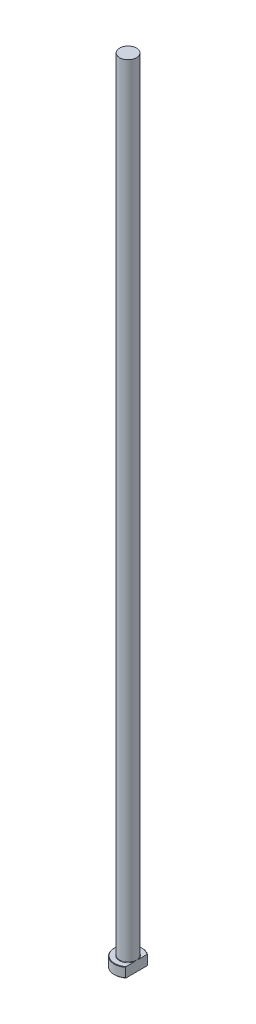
from build123d import *
from build123d.topology import SkipClean

# Parameters (mm, degrees)
CHAMFER1_SIZE = 0.2
FILLET1_R     = 0.2
KEY_DEPTH     = 401.122481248


with BuildPart() as part:
    # Sketch1 → Revolve1 (revolve)
    with BuildSketch(Plane.XY, mode=Mode.PRIVATE) as revolve1_sk:
        Polygon((0, 0), (-7, 0), (-7, 5), (-4.25, 5), (-4.25, 400), (0, 400), align=None)
    revolve(revolve1_sk.sketch.rotate(Axis((0, 259.958771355, 0), (0, -1, 0)), 270), axis=Axis((0, 259.958771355, 0), (0, -1, 0)))

    # Chamfer1
    chamfer1_edges = [part.edges().sort_by_distance(p)[0] for p in [
        (0, 5, -7),
        (0, 0, -7),
    ]]
    chamfer(chamfer1_edges, length=CHAMFER1_SIZE)

    # Fillet1
    fillet1_edges = [part.edges().sort_by_distance(p)[0] for p in [
        (0, 5, -4.25),
    ]]
    fillet(fillet1_edges, radius=FILLET1_R)

    # Sketch2 → KEY (cut, through all)
    with SkipClean():  # the faces are left unmerged after this step: merging them gives an invalid solid
        with BuildSketch(Plane(origin=(0, 0, 0), x_dir=(1, 0, 0), z_dir=(0, 1, 0))):
            with BuildLine():
                Line((4.25, 5.562148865), (4.25, -5.562148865))
                ThreePointArc((4.25, -5.562148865), (7, 0), (4.25, 5.562148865))
            make_face()
        extrude(amount=KEY_DEPTH, mode=Mode.SUBTRACT)


solid = part.part
